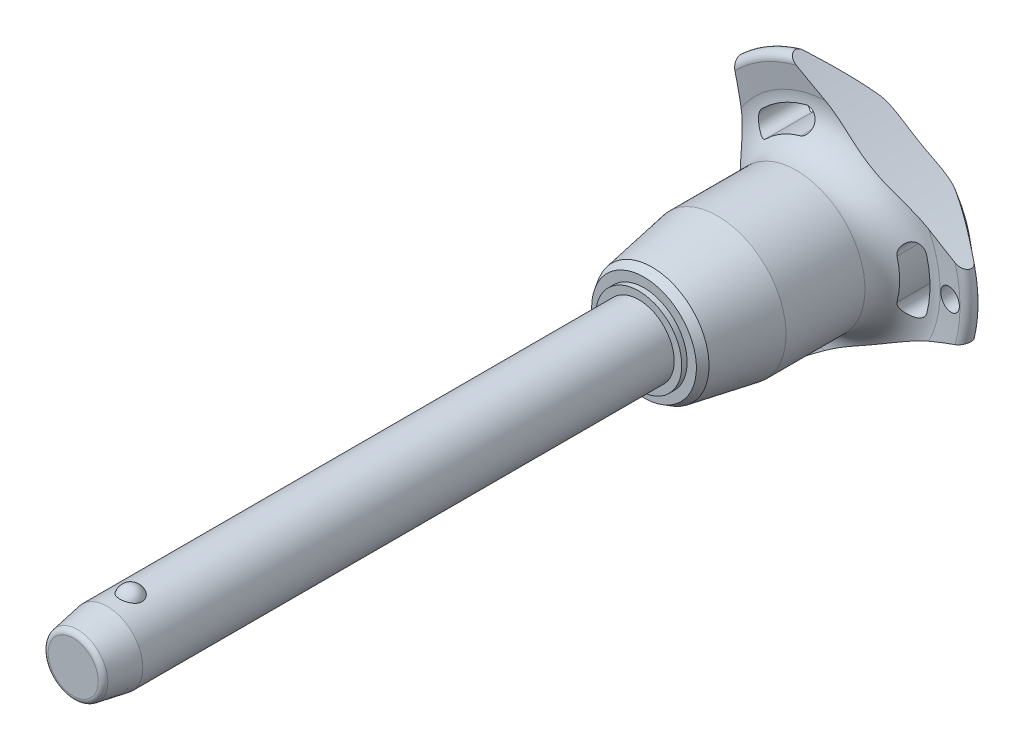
from build123d import *

# Parameters (mm, degrees)
SKETCH1_R           = 5
BOSS_EXTRUDE1_DEPTH = 70
SKETCH2_R           = 4.25
BOSS_EXTRUDE2_DEPTH = 33.3
BOSS_EXTRUDE3_START = 9.6
SKETCH1_2_R         = 5
BOSS_EXTRUDE3_DEPTH = 9.6
CHAMFER1_SIZE       = 4.8
CHAMFER1_SIZE2      = 0.846369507
FILLET1_R           = 0.75
SKETCH6_R           = 102.8
CUT_EXTRUDE1_DEPTH  = 107.957722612
CIRPATTERN1_COUNT   = 3
SKETCH7_R           = 1.5
CUT_EXTRUDE2_DEPTH  = 107.806398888


with BuildPart() as part:
    # Sketch1 → Boss-Extrude1 (new body)
    with BuildSketch(Plane.XY):
        Circle(SKETCH1_R)
    extrude(amount=-BOSS_EXTRUDE1_DEPTH)

    # Sketch2 → Boss-Extrude2 (add)
    with BuildSketch(Plane(origin=(0, 0, -70), x_dir=(-1, 0, 0), z_dir=(0, 0, -1))):
        Circle(SKETCH2_R)
    extrude(amount=BOSS_EXTRUDE2_DEPTH)

    # Sketch3 → Revolve1 (revolve)
    with BuildSketch(Plane(origin=(0, 0, 0), x_dir=(0, 0, -1), z_dir=(1, 0, 0))):
        with BuildLine():
            Line((-1.516575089, 6), (-1.516575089, 2.7))
            ThreePointArc((-1.516575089, 2.7), (0.133424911, 4.35), (-1.516575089, 6))
        make_face()
        with BuildLine():
            Line((-1.516575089, -2.7), (-1.516575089, -6))
            ThreePointArc((-1.516575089, -6), (0.133424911, -4.35), (-1.516575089, -2.7))
        make_face()
    revolve(axis=Axis((0, -2.7, 1.516575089), (0, 1, 0)))

    # Sketch1_2 → Boss-Extrude3 (add)
    with BuildSketch(Plane.XY.offset(BOSS_EXTRUDE3_START)):
        Circle(SKETCH1_2_R)
    extrude(amount=-BOSS_EXTRUDE3_DEPTH)

    # Chamfer1
    chamfer1_edges = [part.edges().sort_by_distance(p)[0] for p in [
        (-5, 0, 9.6),
    ]]
    chamfer1_side = [part.faces().sort_by_distance(p)[0] for p in [
        (-5, 0, -30.2),
    ]]
    chamfer(chamfer1_edges, length=CHAMFER1_SIZE, length2=CHAMFER1_SIZE2, reference=chamfer1_side[0])

    # Fillet1
    fillet1_edges = [part.edges().sort_by_distance(p)[0] for p in [
        (-4.153630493, 0, 9.6),
        (4.25, 0, -103.3),
    ]]
    fillet(fillet1_edges, radius=FILLET1_R)

    # Sketch4 → Revolve2 (revolve)
    with BuildSketch(Plane(origin=(0, 0, 0), x_dir=(0, 0, -1), z_dir=(1, 0, 0)), mode=Mode.PRIVATE) as revolve2_sk:
        Polygon((70, 0), (70, 6.067402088), (70.75, 6.067402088), (70.75, 7.371950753), (71.879772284, 8.024225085), (81.1, 9.65), (92.2, 9.65), (92.2, 0), align=None)
    revolve(revolve2_sk.sketch.rotate(Axis((0, 0, -92.2), (0, 0, 1)), 90), axis=Axis((0, 0, -92.2), (0, 0, 1)))

    # Sketch5 → Revolve3 (revolve)
    with BuildSketch(Plane(origin=(0, 0, 0), x_dir=(0, 0, -1), z_dir=(1, 0, 0)), mode=Mode.PRIVATE) as revolve3_sk:
        with BuildLine():
            Line((97.16082631, 15.274661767), (96.757834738, 18.475067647))
            ThreePointArc((96.757834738, 18.475067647), (97.349836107, 19.516443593), (98.516044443, 19.24278761))
            Line((98.516044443, 19.24278761), (102.835691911, 14.094832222))
            ThreePointArc((102.835691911, 14.094832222), (103.3, 12.689260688), (102.67067517, 11.349423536))
            ThreePointArc((102.67067517, 11.349423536), (99.033110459, 6.185112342), (97.75, 0))
            Line((97.75, 0), (92.2, 0))
            Line((92.2, 0), (92.2, 9.65))
            ThreePointArc((92.2, 9.65), (95.949887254, 11.342683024), (97.16082631, 15.274661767))
        make_face()
    revolve(revolve3_sk.sketch.rotate(Axis((0, 0, -97.75), (0, 0, 1)), 90), axis=Axis((0, 0, -97.75), (0, 0, 1)))

    # Sketch6 → Cut-Extrude1 (cut, through all)
    with BuildSketch(Plane.XY):
        with Locations((-115.2, 0)):
            Circle(SKETCH6_R)
        with BuildLine():
            ThreePointArc((13.411913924, -3.529271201), (13.868496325, 0), (13.411913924, 3.529271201))
            ThreePointArc((13.411913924, 3.529271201), (11.694200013, 4.531299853), (10.692171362, 2.813585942))
            ThreePointArc((10.692171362, 2.813585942), (11.056165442, 0), (10.692171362, -2.813585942))
            ThreePointArc((10.692171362, -2.813585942), (11.694200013, -4.531299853), (13.411913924, -3.529271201))
        make_face()
    cut_extrude1 = extrude(amount=-CUT_EXTRUDE1_DEPTH, mode=Mode.SUBTRACT)

    # CirPattern1: Cut-Extrude1 ×3 about axis
    cirpattern1_axis = Axis((0, 0, 0), (0, 0, 1))
    for i in range(1, CIRPATTERN1_COUNT):
        add(cut_extrude1.rotate(cirpattern1_axis, i * 360 / CIRPATTERN1_COUNT), mode=Mode.SUBTRACT)

    # Sketch7 → Cut-Extrude2 (cut, through all)
    with BuildSketch(Plane.XY):
        with Locations(Location((16.868496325, 0, 0), (0, 0, 225.467095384))):
            Circle(SKETCH7_R)
    extrude(amount=-CUT_EXTRUDE2_DEPTH, mode=Mode.SUBTRACT)


solid = part.part
